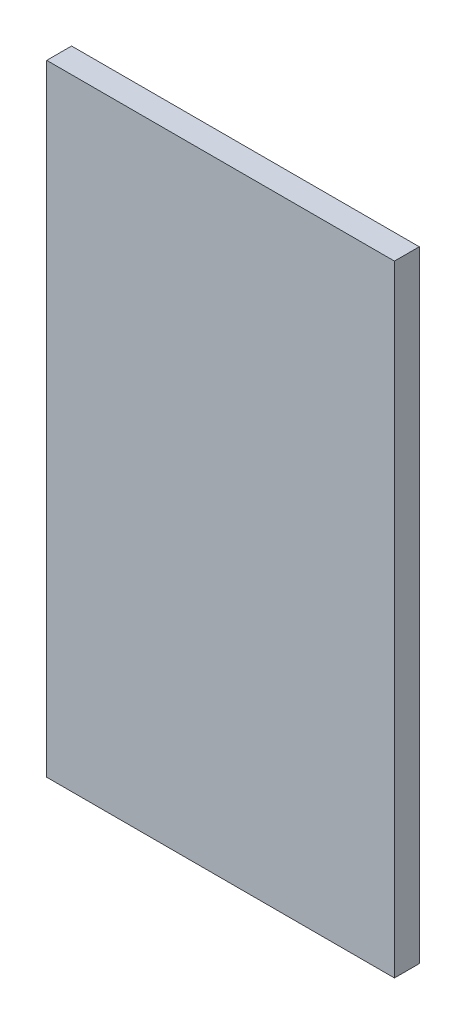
from build123d import *

# Parameters (mm, degrees)
SKETCH1_W           = 3
SKETCH1_H           = 75
BOSS_EXTRUDE1_DEPTH = 21


with BuildPart() as part:
    # Sketch1 → Boss-Extrude1 (new, symmetric)
    with BuildSketch(Plane(origin=(0, 0, 0), x_dir=(0, 0, -1), z_dir=(1, 0, 0))):
        Rectangle(SKETCH1_W, SKETCH1_H)
    extrude(amount=BOSS_EXTRUDE1_DEPTH, both=True)


solid = part.part
